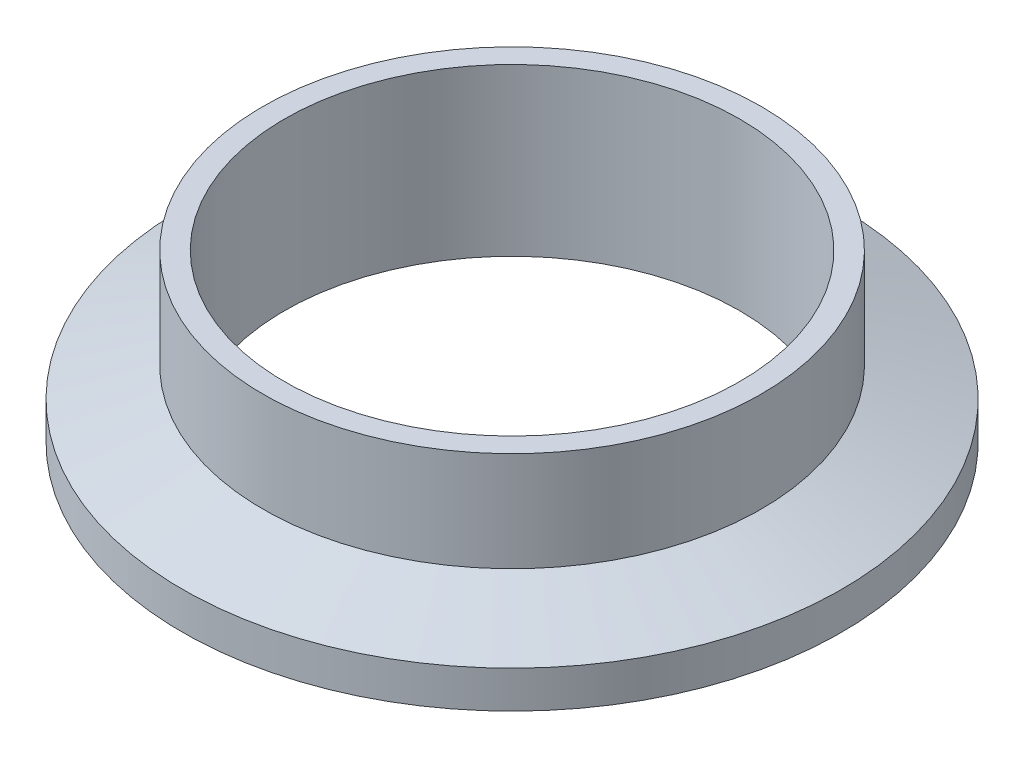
from build123d import *


with BuildPart() as part:
    # Sketch1 → Revolve2 (revolve)
    with BuildSketch(Plane.XY, mode=Mode.PRIVATE) as revolve2_sk:
        with BuildLine():
            Line((-17.399, 0), (-17.399, 12.7))
            Line((-17.399, 12.7), (-19.05, 12.7))
            Line((-19.05, 12.7), (-19.05, 5.082052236))
            Line((-19.05, 5.082052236), (-25.1968, 2.8448))
            Line((-25.1968, 2.8448), (-25.1968, 0))
            Line((-25.1968, 0), (-23.952159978, 0))
            ThreePointArc((-23.952159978, 0), (-23.531583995, 0.126579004), (-23.25073528, 0.46426288))
            Line((-23.25073528, 0.46426288), (-23.077298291, 0.872854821))
            ThreePointArc((-23.077298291, 0.872854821), (-22.04021236, 1.598598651), (-20.933632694, 0.983998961))
            Line((-20.933632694, 0.983998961), (-20.713017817, 0.46426288))
            ThreePointArc((-20.713017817, 0.46426288), (-20.432169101, 0.126579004), (-20.011593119, 0))
            Line((-20.011593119, 0), (-17.399, 0))
        make_face()
    revolve(revolve2_sk.sketch.rotate(Axis((0, 0, 0), (0, 1, 0)), 270), axis=Axis((0, 0, 0), (0, 1, 0)))


solid = part.part
